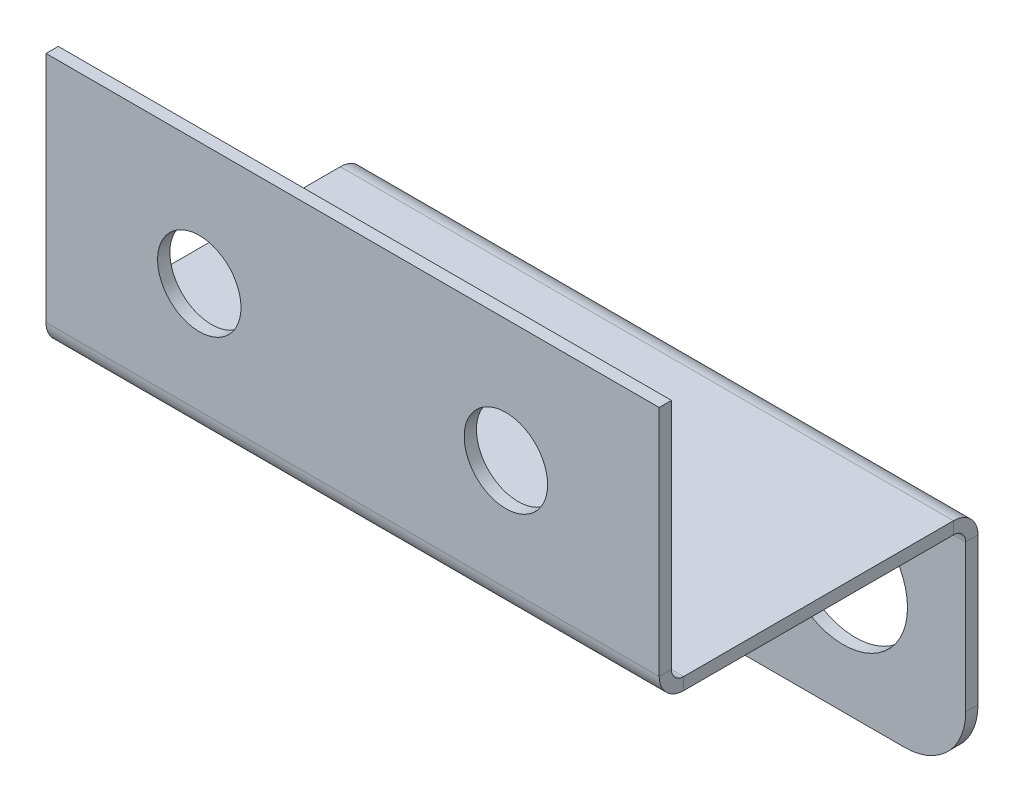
ISO-10303-21;
HEADER;
FILE_DESCRIPTION(('STEP AP214'),'2;1');
FILE_NAME('part.step','',(''),(''),'','','');
FILE_SCHEMA(('AUTOMOTIVE_DESIGN { 1 0 10303 214 1 1 1 1 }'));
ENDSEC;
DATA;
#1=APPLICATION_CONTEXT('core data for automotive mechanical design processes');
#2=APPLICATION_PROTOCOL_DEFINITION('international standard','automotive_design',2000,#1);
#3=PRODUCT_CONTEXT('',#1,'mechanical');
#4=PRODUCT('Part','Part','',(#3));
#5=PRODUCT_RELATED_PRODUCT_CATEGORY('part','',(#4));
#6=PRODUCT_DEFINITION_FORMATION('','',#4);
#7=PRODUCT_DEFINITION_CONTEXT('part definition',#1,'design');
#8=PRODUCT_DEFINITION('design','',#6,#7);
#9=PRODUCT_DEFINITION_SHAPE('','',#8);
#10=(LENGTH_UNIT() NAMED_UNIT(*) SI_UNIT(.MILLI.,.METRE.));
#11=(NAMED_UNIT(*) PLANE_ANGLE_UNIT() SI_UNIT($,.RADIAN.));
#12=(NAMED_UNIT(*) SI_UNIT($,.STERADIAN.) SOLID_ANGLE_UNIT());
#13=UNCERTAINTY_MEASURE_WITH_UNIT(LENGTH_MEASURE(1.E-05),#10,'distance_accuracy_value','');
#14=(GEOMETRIC_REPRESENTATION_CONTEXT(3) GLOBAL_UNCERTAINTY_ASSIGNED_CONTEXT((#13)) GLOBAL_UNIT_ASSIGNED_CONTEXT((#10,
#11,#12)) REPRESENTATION_CONTEXT('',''));
#15=CARTESIAN_POINT('',(0.,0.,0.));
#16=DIRECTION('',(0.,0.,1.));
#17=DIRECTION('',(1.,0.,0.));
#18=AXIS2_PLACEMENT_3D('',#15,#16,#17);
#19=CARTESIAN_POINT('',(25.0000000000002,-20.0000000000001,-1.));
#20=DIRECTION('',(1.00000000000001,0.,0.));
#21=DIRECTION('',(0.,0.,-1.));
#22=AXIS2_PLACEMENT_3D('',#19,#20,#21);
#23=PLANE('',#22);
#24=DIRECTION('',(0.,-1.00000000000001,0.));
#25=VECTOR('',#24,1.);
#26=CARTESIAN_POINT('',(25.0000000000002,-20.0000000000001,-1.));
#27=LINE('',#26,#25);
#28=CARTESIAN_POINT('',(25.0000000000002,-20.0000000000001,-1.));
#29=VERTEX_POINT('',#28);
#30=CARTESIAN_POINT('',(25.0000000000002,-21.0000000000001,-1.));
#31=VERTEX_POINT('',#30);
#32=EDGE_CURVE('E325',#29,#31,#27,.T.);
#33=ORIENTED_EDGE('',*,*,#32,.F.);
#34=CARTESIAN_POINT('',(25.0000000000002,-19.0000000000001,-1.));
#35=DIRECTION('',(-1.00000000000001,0.,0.));
#36=DIRECTION('',(0.,0.,1.));
#37=AXIS2_PLACEMENT_3D('',#34,#35,#36);
#38=CIRCLE('',#37,1.);
#39=CARTESIAN_POINT('',(25.0000000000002,-19.0000000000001,0.));
#40=VERTEX_POINT('',#39);
#41=EDGE_CURVE('E245',#40,#29,#38,.F.);
#42=ORIENTED_EDGE('',*,*,#41,.F.);
#43=DIRECTION('',(0.,0.,-1.));
#44=VECTOR('',#43,1.);
#45=CARTESIAN_POINT('',(25.0000000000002,-19.0000000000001,1.));
#46=LINE('',#45,#44);
#47=CARTESIAN_POINT('',(25.0000000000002,-19.0000000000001,1.));
#48=VERTEX_POINT('',#47);
#49=EDGE_CURVE('E322',#48,#40,#46,.T.);
#50=ORIENTED_EDGE('',*,*,#49,.F.);
#51=CARTESIAN_POINT('',(25.0000000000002,-19.0000000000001,-1.));
#52=DIRECTION('',(1.00000000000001,0.,0.));
#53=DIRECTION('',(0.,0.,-1.));
#54=AXIS2_PLACEMENT_3D('',#51,#52,#53);
#55=CIRCLE('',#54,2.);
#56=EDGE_CURVE('E261',#48,#31,#55,.T.);
#57=ORIENTED_EDGE('',*,*,#56,.T.);
#58=EDGE_LOOP('',(#33,#42,#50,#57));
#59=FACE_BOUND('',#58,.T.);
#60=ADVANCED_FACE('F56',(#59),#23,.T.);
#61=CARTESIAN_POINT('',(25.0000000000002,-19.0000000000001,1.));
#62=DIRECTION('',(1.00000000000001,0.,0.));
#63=DIRECTION('',(0.,0.,-1.));
#64=AXIS2_PLACEMENT_3D('',#61,#62,#63);
#65=PLANE('',#64);
#66=DIRECTION('',(0.,0.,-1.));
#67=VECTOR('',#66,1.);
#68=CARTESIAN_POINT('',(25.0000000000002,-20.0000000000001,0.));
#69=LINE('',#68,#67);
#70=CARTESIAN_POINT('',(25.0000000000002,-20.0000000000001,-23.));
#71=VERTEX_POINT('',#70);
#72=EDGE_CURVE('E241',#29,#71,#69,.T.);
#73=ORIENTED_EDGE('',*,*,#72,.F.);
#74=ORIENTED_EDGE('',*,*,#32,.T.);
#75=DIRECTION('',(0.,0.,-1.));
#76=VECTOR('',#75,1.);
#77=CARTESIAN_POINT('',(25.0000000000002,-21.0000000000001,0.));
#78=LINE('',#77,#76);
#79=CARTESIAN_POINT('',(25.0000000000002,-21.0000000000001,-23.));
#80=VERTEX_POINT('',#79);
#81=EDGE_CURVE('E265',#31,#80,#78,.T.);
#82=ORIENTED_EDGE('',*,*,#81,.T.);
#83=DIRECTION('',(0.,1.00000000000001,0.));
#84=VECTOR('',#83,1.);
#85=CARTESIAN_POINT('',(25.0000000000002,-21.0000000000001,-23.));
#86=LINE('',#85,#84);
#87=EDGE_CURVE('E310',#80,#71,#86,.T.);
#88=ORIENTED_EDGE('',*,*,#87,.T.);
#89=EDGE_LOOP('',(#73,#74,#82,#88));
#90=FACE_BOUND('',#89,.T.);
#91=ADVANCED_FACE('F439',(#90),#65,.T.);
#92=CARTESIAN_POINT('',(-25.0000000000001,-19.0000000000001,0.));
#93=DIRECTION('',(-1.00000000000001,0.,0.));
#94=DIRECTION('',(0.,0.,1.));
#95=AXIS2_PLACEMENT_3D('',#92,#93,#94);
#96=PLANE('',#95);
#97=DIRECTION('',(0.,0.,1.));
#98=VECTOR('',#97,1.);
#99=CARTESIAN_POINT('',(-25.0000000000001,-19.0000000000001,0.));
#100=LINE('',#99,#98);
#101=CARTESIAN_POINT('',(-25.0000000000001,-19.0000000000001,0.));
#102=VERTEX_POINT('',#101);
#103=CARTESIAN_POINT('',(-25.0000000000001,-19.0000000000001,1.));
#104=VERTEX_POINT('',#103);
#105=EDGE_CURVE('E319',#102,#104,#100,.T.);
#106=ORIENTED_EDGE('',*,*,#105,.F.);
#107=CARTESIAN_POINT('',(-25.0000000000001,-19.0000000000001,-1.));
#108=DIRECTION('',(-1.00000000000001,0.,0.));
#109=DIRECTION('',(0.,0.,1.));
#110=AXIS2_PLACEMENT_3D('',#107,#108,#109);
#111=CIRCLE('',#110,1.);
#112=CARTESIAN_POINT('',(-25.0000000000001,-20.0000000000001,-1.));
#113=VERTEX_POINT('',#112);
#114=EDGE_CURVE('E204',#102,#113,#111,.F.);
#115=ORIENTED_EDGE('',*,*,#114,.T.);
#116=DIRECTION('',(0.,1.00000000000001,0.));
#117=VECTOR('',#116,1.);
#118=CARTESIAN_POINT('',(-25.0000000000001,-21.0000000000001,-1.));
#119=LINE('',#118,#117);
#120=CARTESIAN_POINT('',(-25.0000000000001,-21.0000000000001,-1.));
#121=VERTEX_POINT('',#120);
#122=EDGE_CURVE('E316',#121,#113,#119,.T.);
#123=ORIENTED_EDGE('',*,*,#122,.F.);
#124=CARTESIAN_POINT('',(-25.0000000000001,-19.0000000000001,-1.));
#125=DIRECTION('',(1.00000000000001,0.,0.));
#126=DIRECTION('',(0.,0.,-1.));
#127=AXIS2_PLACEMENT_3D('',#124,#125,#126);
#128=CIRCLE('',#127,2.);
#129=EDGE_CURVE('E223',#104,#121,#128,.T.);
#130=ORIENTED_EDGE('',*,*,#129,.F.);
#131=EDGE_LOOP('',(#106,#115,#123,#130));
#132=FACE_BOUND('',#131,.T.);
#133=ADVANCED_FACE('F411',(#132),#96,.T.);
#134=CARTESIAN_POINT('',(-25.0000000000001,-21.0000000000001,-1.));
#135=DIRECTION('',(-1.00000000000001,0.,0.));
#136=DIRECTION('',(0.,0.,1.));
#137=AXIS2_PLACEMENT_3D('',#134,#135,#136);
#138=PLANE('',#137);
#139=DIRECTION('',(0.,-1.00000000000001,0.));
#140=VECTOR('',#139,1.);
#141=CARTESIAN_POINT('',(-25.0000000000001,0.,0.));
#142=LINE('',#141,#140);
#143=CARTESIAN_POINT('',(-25.0000000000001,0.,0.));
#144=VERTEX_POINT('',#143);
#145=EDGE_CURVE('E211',#144,#102,#142,.T.);
#146=ORIENTED_EDGE('',*,*,#145,.T.);
#147=ORIENTED_EDGE('',*,*,#105,.T.);
#148=DIRECTION('',(0.,-1.00000000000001,0.));
#149=VECTOR('',#148,1.);
#150=CARTESIAN_POINT('',(-25.0000000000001,0.,1.));
#151=LINE('',#150,#149);
#152=CARTESIAN_POINT('',(-25.0000000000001,0.,1.));
#153=VERTEX_POINT('',#152);
#154=EDGE_CURVE('E219',#153,#104,#151,.T.);
#155=ORIENTED_EDGE('',*,*,#154,.F.);
#156=DIRECTION('',(0.,0.,-1.));
#157=VECTOR('',#156,1.);
#158=CARTESIAN_POINT('',(-25.0000000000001,0.,1.));
#159=LINE('',#158,#157);
#160=EDGE_CURVE('E215',#153,#144,#159,.T.);
#161=ORIENTED_EDGE('',*,*,#160,.T.);
#162=EDGE_LOOP('',(#146,#147,#155,#161));
#163=FACE_BOUND('',#162,.T.);
#164=ADVANCED_FACE('F419',(#163),#138,.T.);
#165=CARTESIAN_POINT('',(25.0000000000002,-22.0000000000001,-24.9999999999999));
#166=DIRECTION('',(1.00000000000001,0.,0.));
#167=DIRECTION('',(0.,0.,-1.));
#168=AXIS2_PLACEMENT_3D('',#165,#166,#167);
#169=PLANE('',#168);
#170=DIRECTION('',(0.,0.,1.));
#171=VECTOR('',#170,1.);
#172=CARTESIAN_POINT('',(25.0000000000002,-22.0000000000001,-24.9999999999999));
#173=LINE('',#172,#171);
#174=CARTESIAN_POINT('',(25.0000000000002,-22.0000000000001,-24.9999999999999));
#175=VERTEX_POINT('',#174);
#176=CARTESIAN_POINT('',(25.0000000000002,-22.0000000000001,-23.9999999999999));
#177=VERTEX_POINT('',#176);
#178=EDGE_CURVE('E313',#175,#177,#173,.T.);
#179=ORIENTED_EDGE('',*,*,#178,.F.);
#180=CARTESIAN_POINT('',(25.0000000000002,-22.0000000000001,-22.9999999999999));
#181=DIRECTION('',(1.00000000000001,0.,0.));
#182=DIRECTION('',(0.,0.,-1.));
#183=AXIS2_PLACEMENT_3D('',#180,#181,#182);
#184=CIRCLE('',#183,2.);
#185=EDGE_CURVE('E186',#71,#175,#184,.F.);
#186=ORIENTED_EDGE('',*,*,#185,.F.);
#187=ORIENTED_EDGE('',*,*,#87,.F.);
#188=CARTESIAN_POINT('',(25.0000000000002,-22.0000000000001,-22.9999999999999));
#189=DIRECTION('',(1.00000000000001,0.,0.));
#190=DIRECTION('',(0.,0.,-1.));
#191=AXIS2_PLACEMENT_3D('',#188,#189,#190);
#192=CIRCLE('',#191,1.);
#193=EDGE_CURVE('E269',#80,#177,#192,.F.);
#194=ORIENTED_EDGE('',*,*,#193,.T.);
#195=EDGE_LOOP('',(#179,#186,#187,#194));
#196=FACE_BOUND('',#195,.T.);
#197=ADVANCED_FACE('F441',(#196),#169,.T.);
#198=CARTESIAN_POINT('',(25.0000000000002,-21.0000000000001,-23.));
#199=DIRECTION('',(1.00000000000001,0.,0.));
#200=DIRECTION('',(0.,0.,-1.));
#201=AXIS2_PLACEMENT_3D('',#198,#199,#200);
#202=PLANE('',#201);
#203=DIRECTION('',(0.,-1.00000000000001,0.));
#204=VECTOR('',#203,1.);
#205=CARTESIAN_POINT('',(25.0000000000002,-20.0000000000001,-24.));
#206=LINE('',#205,#204);
#207=CARTESIAN_POINT('',(25.,-34.0000000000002,-24.));
#208=VERTEX_POINT('',#207);
#209=EDGE_CURVE('E234',#177,#208,#206,.T.);
#210=ORIENTED_EDGE('',*,*,#209,.T.);
#211=DIRECTION('',(0.,0.,1.));
#212=VECTOR('',#211,1.);
#213=CARTESIAN_POINT('',(25.,-34.0000000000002,-23.));
#214=LINE('',#213,#212);
#215=CARTESIAN_POINT('',(25.,-34.0000000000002,-25.));
#216=VERTEX_POINT('',#215);
#217=EDGE_CURVE('E11',#208,#216,#214,.F.);
#218=ORIENTED_EDGE('',*,*,#217,.T.);
#219=DIRECTION('',(0.,-1.00000000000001,0.));
#220=VECTOR('',#219,1.);
#221=CARTESIAN_POINT('',(25.0000000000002,-20.0000000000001,-25.));
#222=LINE('',#221,#220);
#223=EDGE_CURVE('E237',#175,#216,#222,.T.);
#224=ORIENTED_EDGE('',*,*,#223,.F.);
#225=ORIENTED_EDGE('',*,*,#178,.T.);
#226=EDGE_LOOP('',(#210,#218,#224,#225));
#227=FACE_BOUND('',#226,.T.);
#228=ADVANCED_FACE('F442',(#227),#202,.T.);
#229=CARTESIAN_POINT('',(-25.0000000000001,-20.0000000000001,-23.));
#230=DIRECTION('',(-1.00000000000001,0.,0.));
#231=DIRECTION('',(0.,0.,1.));
#232=AXIS2_PLACEMENT_3D('',#229,#230,#231);
#233=PLANE('',#232);
#234=DIRECTION('',(0.,-1.00000000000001,0.));
#235=VECTOR('',#234,1.);
#236=CARTESIAN_POINT('',(-25.0000000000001,-20.0000000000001,-23.));
#237=LINE('',#236,#235);
#238=CARTESIAN_POINT('',(-25.0000000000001,-20.0000000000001,-23.));
#239=VERTEX_POINT('',#238);
#240=CARTESIAN_POINT('',(-25.0000000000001,-21.0000000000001,-23.));
#241=VERTEX_POINT('',#240);
#242=EDGE_CURVE('E173',#239,#241,#237,.T.);
#243=ORIENTED_EDGE('',*,*,#242,.F.);
#244=CARTESIAN_POINT('',(-25.0000000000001,-22.0000000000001,-23.));
#245=DIRECTION('',(1.00000000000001,0.,0.));
#246=DIRECTION('',(0.,0.,-1.));
#247=AXIS2_PLACEMENT_3D('',#244,#245,#246);
#248=CIRCLE('',#247,2.);
#249=CARTESIAN_POINT('',(-25.0000000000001,-22.0000000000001,-25.));
#250=VERTEX_POINT('',#249);
#251=EDGE_CURVE('E183',#239,#250,#248,.F.);
#252=ORIENTED_EDGE('',*,*,#251,.T.);
#253=DIRECTION('',(0.,0.,-1.));
#254=VECTOR('',#253,1.);
#255=CARTESIAN_POINT('',(-25.0000000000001,-22.0000000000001,-24.));
#256=LINE('',#255,#254);
#257=CARTESIAN_POINT('',(-25.0000000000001,-22.0000000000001,-24.));
#258=VERTEX_POINT('',#257);
#259=EDGE_CURVE('E159',#258,#250,#256,.T.);
#260=ORIENTED_EDGE('',*,*,#259,.F.);
#261=CARTESIAN_POINT('',(-25.0000000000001,-22.0000000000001,-23.));
#262=DIRECTION('',(1.00000000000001,0.,0.));
#263=DIRECTION('',(0.,0.,-1.));
#264=AXIS2_PLACEMENT_3D('',#261,#262,#263);
#265=CIRCLE('',#264,1.);
#266=EDGE_CURVE('E231',#241,#258,#265,.F.);
#267=ORIENTED_EDGE('',*,*,#266,.F.);
#268=EDGE_LOOP('',(#243,#252,#260,#267));
#269=FACE_BOUND('',#268,.T.);
#270=ADVANCED_FACE('F196',(#269),#233,.T.);
#271=CARTESIAN_POINT('',(-25.0000000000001,-22.0000000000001,-24.));
#272=DIRECTION('',(-1.00000000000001,0.,0.));
#273=DIRECTION('',(0.,0.,1.));
#274=AXIS2_PLACEMENT_3D('',#271,#272,#273);
#275=PLANE('',#274);
#276=DIRECTION('',(0.,0.,-1.));
#277=VECTOR('',#276,1.);
#278=CARTESIAN_POINT('',(-25.0000000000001,-20.0000000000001,0.));
#279=LINE('',#278,#277);
#280=EDGE_CURVE('E199',#113,#239,#279,.T.);
#281=ORIENTED_EDGE('',*,*,#280,.T.);
#282=ORIENTED_EDGE('',*,*,#242,.T.);
#283=DIRECTION('',(0.,0.,-1.));
#284=VECTOR('',#283,1.);
#285=CARTESIAN_POINT('',(-25.0000000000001,-21.0000000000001,0.));
#286=LINE('',#285,#284);
#287=EDGE_CURVE('E227',#121,#241,#286,.T.);
#288=ORIENTED_EDGE('',*,*,#287,.F.);
#289=ORIENTED_EDGE('',*,*,#122,.T.);
#290=EDGE_LOOP('',(#281,#282,#288,#289));
#291=FACE_BOUND('',#290,.T.);
#292=ADVANCED_FACE('F387',(#291),#275,.T.);
#293=CARTESIAN_POINT('',(25.0000000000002,-20.0000000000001,-24.));
#294=DIRECTION('',(0.,0.,-1.));
#295=DIRECTION('',(0.,1.00000000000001,0.));
#296=AXIS2_PLACEMENT_3D('',#293,#294,#295);
#297=PLANE('',#296);
#298=CARTESIAN_POINT('',(-15.0000000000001,-29.0000000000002,-24.));
#299=DIRECTION('',(0.,0.,1.));
#300=DIRECTION('',(1.00000000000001,0.,0.));
#301=AXIS2_PLACEMENT_3D('',#298,#299,#300);
#302=CIRCLE('',#301,5.25);
#303=CARTESIAN_POINT('',(-9.7500000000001,-29.0000000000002,-24.));
#304=VERTEX_POINT('',#303);
#305=EDGE_CURVE('E349',#304,#304,#302,.T.);
#306=ORIENTED_EDGE('',*,*,#305,.F.);
#307=EDGE_LOOP('',(#306));
#308=FACE_BOUND('',#307,.T.);
#309=CARTESIAN_POINT('',(15.,-29.0000000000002,-24.));
#310=DIRECTION('',(0.,0.,1.));
#311=DIRECTION('',(1.00000000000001,0.,0.));
#312=AXIS2_PLACEMENT_3D('',#309,#310,#311);
#313=CIRCLE('',#312,5.25);
#314=CARTESIAN_POINT('',(20.25,-29.0000000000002,-24.));
#315=VERTEX_POINT('',#314);
#316=EDGE_CURVE('E352',#315,#315,#313,.T.);
#317=ORIENTED_EDGE('',*,*,#316,.F.);
#318=EDGE_LOOP('',(#317));
#319=FACE_BOUND('',#318,.T.);
#320=DIRECTION('',(0.,-1.00000000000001,0.));
#321=VECTOR('',#320,1.);
#322=CARTESIAN_POINT('',(-25.0000000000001,-20.0000000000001,-24.));
#323=LINE('',#322,#321);
#324=CARTESIAN_POINT('',(-25.0000000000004,-34.0000000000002,-24.));
#325=VERTEX_POINT('',#324);
#326=EDGE_CURVE('E167',#258,#325,#323,.T.);
#327=ORIENTED_EDGE('',*,*,#326,.T.);
#328=CARTESIAN_POINT('',(-20.0000000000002,-34.0000000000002,-24.));
#329=DIRECTION('',(0.,0.,-1.));
#330=DIRECTION('',(0.,1.00000000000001,0.));
#331=AXIS2_PLACEMENT_3D('',#328,#329,#330);
#332=CIRCLE('',#331,5.);
#333=CARTESIAN_POINT('',(-20.,-39.0000000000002,-24.));
#334=VERTEX_POINT('',#333);
#335=EDGE_CURVE('E334',#325,#334,#332,.F.);
#336=ORIENTED_EDGE('',*,*,#335,.T.);
#337=DIRECTION('',(-1.00000000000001,0.,0.));
#338=VECTOR('',#337,1.);
#339=CARTESIAN_POINT('',(25.0000000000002,-39.0000000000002,-24.));
#340=LINE('',#339,#338);
#341=CARTESIAN_POINT('',(20.0000000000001,-39.0000000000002,-24.));
#342=VERTEX_POINT('',#341);
#343=EDGE_CURVE('E174',#342,#334,#340,.T.);
#344=ORIENTED_EDGE('',*,*,#343,.F.);
#345=CARTESIAN_POINT('',(19.9999999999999,-34.0000000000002,-24.));
#346=DIRECTION('',(0.,0.,-1.));
#347=DIRECTION('',(0.,1.00000000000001,0.));
#348=AXIS2_PLACEMENT_3D('',#345,#346,#347);
#349=CIRCLE('',#348,5.);
#350=EDGE_CURVE('E331',#342,#208,#349,.F.);
#351=ORIENTED_EDGE('',*,*,#350,.T.);
#352=ORIENTED_EDGE('',*,*,#209,.F.);
#353=DIRECTION('',(-1.00000000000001,0.,0.));
#354=VECTOR('',#353,1.);
#355=CARTESIAN_POINT('',(25.0000000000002,-22.0000000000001,-23.9999999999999));
#356=LINE('',#355,#354);
#357=EDGE_CURVE('E273',#177,#258,#356,.T.);
#358=ORIENTED_EDGE('',*,*,#357,.T.);
#359=EDGE_LOOP('',(#327,#336,#344,#351,#352,#358));
#360=FACE_BOUND('',#359,.T.);
#361=ADVANCED_FACE('F383',(#308,#319,#360),#297,.F.);
#362=CARTESIAN_POINT('',(25.0000000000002,-39.0000000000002,-25.));
#363=DIRECTION('',(0.,-1.00000000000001,0.));
#364=DIRECTION('',(0.,0.,-1.));
#365=AXIS2_PLACEMENT_3D('',#362,#363,#364);
#366=PLANE('',#365);
#367=ORIENTED_EDGE('',*,*,#343,.T.);
#368=DIRECTION('',(0.,0.,1.));
#369=VECTOR('',#368,1.);
#370=CARTESIAN_POINT('',(-20.,-39.0000000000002,-25.));
#371=LINE('',#370,#369);
#372=CARTESIAN_POINT('',(-20.,-39.0000000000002,-25.));
#373=VERTEX_POINT('',#372);
#374=EDGE_CURVE('E77',#334,#373,#371,.F.);
#375=ORIENTED_EDGE('',*,*,#374,.T.);
#376=DIRECTION('',(-1.00000000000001,0.,0.));
#377=VECTOR('',#376,1.);
#378=CARTESIAN_POINT('',(25.0000000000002,-39.0000000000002,-25.));
#379=LINE('',#378,#377);
#380=CARTESIAN_POINT('',(20.0000000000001,-39.0000000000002,-25.));
#381=VERTEX_POINT('',#380);
#382=EDGE_CURVE('E189',#381,#373,#379,.T.);
#383=ORIENTED_EDGE('',*,*,#382,.F.);
#384=DIRECTION('',(0.,0.,1.));
#385=VECTOR('',#384,1.);
#386=CARTESIAN_POINT('',(20.0000000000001,-39.0000000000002,-25.));
#387=LINE('',#386,#385);
#388=EDGE_CURVE('E337',#381,#342,#387,.T.);
#389=ORIENTED_EDGE('',*,*,#388,.T.);
#390=EDGE_LOOP('',(#367,#375,#383,#389));
#391=FACE_BOUND('',#390,.T.);
#392=ADVANCED_FACE('F386',(#391),#366,.T.);
#393=CARTESIAN_POINT('',(25.0000000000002,-20.0000000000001,-25.));
#394=DIRECTION('',(0.,0.,-1.));
#395=DIRECTION('',(0.,1.00000000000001,0.));
#396=AXIS2_PLACEMENT_3D('',#393,#394,#395);
#397=PLANE('',#396);
#398=CARTESIAN_POINT('',(-15.0000000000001,-29.0000000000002,-25.));
#399=DIRECTION('',(0.,0.,-1.));
#400=DIRECTION('',(0.,1.00000000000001,0.));
#401=AXIS2_PLACEMENT_3D('',#398,#399,#400);
#402=CIRCLE('',#401,5.25);
#403=CARTESIAN_POINT('',(-15.0000000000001,-23.7500000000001,-25.));
#404=VERTEX_POINT('',#403);
#405=EDGE_CURVE('E347',#404,#404,#402,.F.);
#406=ORIENTED_EDGE('',*,*,#405,.T.);
#407=EDGE_LOOP('',(#406));
#408=FACE_BOUND('',#407,.T.);
#409=CARTESIAN_POINT('',(15.,-29.0000000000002,-25.));
#410=DIRECTION('',(0.,0.,-1.));
#411=DIRECTION('',(0.,1.00000000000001,0.));
#412=AXIS2_PLACEMENT_3D('',#409,#410,#411);
#413=CIRCLE('',#412,5.25);
#414=CARTESIAN_POINT('',(15.,-23.7500000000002,-25.));
#415=VERTEX_POINT('',#414);
#416=EDGE_CURVE('E356',#415,#415,#413,.F.);
#417=ORIENTED_EDGE('',*,*,#416,.T.);
#418=EDGE_LOOP('',(#417));
#419=FACE_BOUND('',#418,.T.);
#420=ORIENTED_EDGE('',*,*,#382,.T.);
#421=CARTESIAN_POINT('',(-20.0000000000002,-34.0000000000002,-25.));
#422=DIRECTION('',(0.,0.,-1.));
#423=DIRECTION('',(0.,1.00000000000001,0.));
#424=AXIS2_PLACEMENT_3D('',#421,#422,#423);
#425=CIRCLE('',#424,5.);
#426=CARTESIAN_POINT('',(-25.0000000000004,-34.0000000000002,-25.));
#427=VERTEX_POINT('',#426);
#428=EDGE_CURVE('E64',#373,#427,#425,.T.);
#429=ORIENTED_EDGE('',*,*,#428,.T.);
#430=DIRECTION('',(0.,-1.00000000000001,0.));
#431=VECTOR('',#430,1.);
#432=CARTESIAN_POINT('',(-25.0000000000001,-20.0000000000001,-25.));
#433=LINE('',#432,#431);
#434=EDGE_CURVE('E164',#250,#427,#433,.T.);
#435=ORIENTED_EDGE('',*,*,#434,.F.);
#436=DIRECTION('',(-1.00000000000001,0.,0.));
#437=VECTOR('',#436,1.);
#438=CARTESIAN_POINT('',(25.0000000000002,-22.0000000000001,-24.9999999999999));
#439=LINE('',#438,#437);
#440=EDGE_CURVE('E180',#175,#250,#439,.T.);
#441=ORIENTED_EDGE('',*,*,#440,.F.);
#442=ORIENTED_EDGE('',*,*,#223,.T.);
#443=CARTESIAN_POINT('',(19.9999999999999,-34.0000000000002,-25.));
#444=DIRECTION('',(0.,0.,-1.));
#445=DIRECTION('',(0.,1.00000000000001,0.));
#446=AXIS2_PLACEMENT_3D('',#443,#444,#445);
#447=CIRCLE('',#446,5.);
#448=EDGE_CURVE('E343',#216,#381,#447,.T.);
#449=ORIENTED_EDGE('',*,*,#448,.T.);
#450=EDGE_LOOP('',(#420,#429,#435,#441,#442,#449));
#451=FACE_BOUND('',#450,.T.);
#452=ADVANCED_FACE('F192',(#408,#419,#451),#397,.T.);
#453=CARTESIAN_POINT('',(25.0000000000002,-22.0000000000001,-22.9999999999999));
#454=DIRECTION('',(-1.00000000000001,0.,0.));
#455=DIRECTION('',(0.,0.,1.));
#456=AXIS2_PLACEMENT_3D('',#453,#454,#455);
#457=CYLINDRICAL_SURFACE('',#456,2.);
#458=ORIENTED_EDGE('',*,*,#251,.F.);
#459=DIRECTION('',(-1.00000000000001,0.,0.));
#460=VECTOR('',#459,1.);
#461=CARTESIAN_POINT('',(25.0000000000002,-20.0000000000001,-23.));
#462=LINE('',#461,#460);
#463=EDGE_CURVE('E190',#71,#239,#462,.T.);
#464=ORIENTED_EDGE('',*,*,#463,.F.);
#465=ORIENTED_EDGE('',*,*,#185,.T.);
#466=ORIENTED_EDGE('',*,*,#440,.T.);
#467=EDGE_LOOP('',(#458,#464,#465,#466));
#468=FACE_BOUND('',#467,.T.);
#469=ADVANCED_FACE('F181',(#468),#457,.T.);
#470=CARTESIAN_POINT('',(25.0000000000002,-20.0000000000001,0.));
#471=DIRECTION('',(0.,1.00000000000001,0.));
#472=DIRECTION('',(0.,0.,1.));
#473=AXIS2_PLACEMENT_3D('',#470,#471,#472);
#474=PLANE('',#473);
#475=ORIENTED_EDGE('',*,*,#280,.F.);
#476=DIRECTION('',(-1.00000000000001,0.,0.));
#477=VECTOR('',#476,1.);
#478=CARTESIAN_POINT('',(25.0000000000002,-20.0000000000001,-1.));
#479=LINE('',#478,#477);
#480=EDGE_CURVE('E299',#29,#113,#479,.T.);
#481=ORIENTED_EDGE('',*,*,#480,.F.);
#482=ORIENTED_EDGE('',*,*,#72,.T.);
#483=ORIENTED_EDGE('',*,*,#463,.T.);
#484=EDGE_LOOP('',(#475,#481,#482,#483));
#485=FACE_BOUND('',#484,.T.);
#486=ADVANCED_FACE('F407',(#485),#474,.T.);
#487=CARTESIAN_POINT('',(25.0000000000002,-19.0000000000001,-1.));
#488=DIRECTION('',(-1.00000000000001,0.,0.));
#489=DIRECTION('',(0.,0.,1.));
#490=AXIS2_PLACEMENT_3D('',#487,#488,#489);
#491=CYLINDRICAL_SURFACE('',#490,1.);
#492=ORIENTED_EDGE('',*,*,#114,.F.);
#493=DIRECTION('',(-1.00000000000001,0.,0.));
#494=VECTOR('',#493,1.);
#495=CARTESIAN_POINT('',(25.0000000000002,-19.0000000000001,0.));
#496=LINE('',#495,#494);
#497=EDGE_CURVE('E295',#40,#102,#496,.T.);
#498=ORIENTED_EDGE('',*,*,#497,.F.);
#499=ORIENTED_EDGE('',*,*,#41,.T.);
#500=ORIENTED_EDGE('',*,*,#480,.T.);
#501=EDGE_LOOP('',(#492,#498,#499,#500));
#502=FACE_BOUND('',#501,.T.);
#503=ADVANCED_FACE('F415',(#502),#491,.F.);
#504=CARTESIAN_POINT('',(25.0000000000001,0.,0.));
#505=DIRECTION('',(0.,0.,-1.));
#506=DIRECTION('',(0.,1.00000000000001,0.));
#507=AXIS2_PLACEMENT_3D('',#504,#505,#506);
#508=PLANE('',#507);
#509=CARTESIAN_POINT('',(-12.5,-10.,0.));
#510=DIRECTION('',(0.,0.,-1.));
#511=DIRECTION('',(0.,1.00000000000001,0.));
#512=AXIS2_PLACEMENT_3D('',#509,#510,#511);
#513=CIRCLE('',#512,3.4);
#514=CARTESIAN_POINT('',(-12.5,-6.60000000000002,0.));
#515=VERTEX_POINT('',#514);
#516=EDGE_CURVE('E355',#515,#515,#513,.F.);
#517=ORIENTED_EDGE('',*,*,#516,.T.);
#518=EDGE_LOOP('',(#517));
#519=FACE_BOUND('',#518,.T.);
#520=CARTESIAN_POINT('',(12.5000000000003,-10.,0.));
#521=DIRECTION('',(0.,0.,-1.));
#522=DIRECTION('',(0.,1.00000000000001,0.));
#523=AXIS2_PLACEMENT_3D('',#520,#521,#522);
#524=CIRCLE('',#523,3.4);
#525=CARTESIAN_POINT('',(12.5000000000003,-6.60000000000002,0.));
#526=VERTEX_POINT('',#525);
#527=EDGE_CURVE('E364',#526,#526,#524,.F.);
#528=ORIENTED_EDGE('',*,*,#527,.T.);
#529=EDGE_LOOP('',(#528));
#530=FACE_BOUND('',#529,.T.);
#531=ORIENTED_EDGE('',*,*,#145,.F.);
#532=DIRECTION('',(-1.00000000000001,0.,0.));
#533=VECTOR('',#532,1.);
#534=CARTESIAN_POINT('',(25.0000000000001,0.,0.));
#535=LINE('',#534,#533);
#536=CARTESIAN_POINT('',(25.0000000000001,0.,0.));
#537=VERTEX_POINT('',#536);
#538=EDGE_CURVE('E292',#537,#144,#535,.T.);
#539=ORIENTED_EDGE('',*,*,#538,.F.);
#540=DIRECTION('',(0.,-1.00000000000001,0.));
#541=VECTOR('',#540,1.);
#542=CARTESIAN_POINT('',(25.0000000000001,0.,0.));
#543=LINE('',#542,#541);
#544=EDGE_CURVE('E249',#537,#40,#543,.T.);
#545=ORIENTED_EDGE('',*,*,#544,.T.);
#546=ORIENTED_EDGE('',*,*,#497,.T.);
#547=EDGE_LOOP('',(#531,#539,#545,#546));
#548=FACE_BOUND('',#547,.T.);
#549=ADVANCED_FACE('F423',(#519,#530,#548),#508,.T.);
#550=CARTESIAN_POINT('',(25.0000000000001,0.,1.));
#551=DIRECTION('',(0.,1.00000000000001,0.));
#552=DIRECTION('',(0.,0.,1.));
#553=AXIS2_PLACEMENT_3D('',#550,#551,#552);
#554=PLANE('',#553);
#555=ORIENTED_EDGE('',*,*,#160,.F.);
#556=DIRECTION('',(-1.00000000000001,0.,0.));
#557=VECTOR('',#556,1.);
#558=CARTESIAN_POINT('',(25.0000000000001,0.,1.));
#559=LINE('',#558,#557);
#560=CARTESIAN_POINT('',(25.0000000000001,0.,1.));
#561=VERTEX_POINT('',#560);
#562=EDGE_CURVE('E289',#561,#153,#559,.T.);
#563=ORIENTED_EDGE('',*,*,#562,.F.);
#564=DIRECTION('',(0.,0.,-1.));
#565=VECTOR('',#564,1.);
#566=CARTESIAN_POINT('',(25.0000000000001,0.,1.));
#567=LINE('',#566,#565);
#568=EDGE_CURVE('E253',#561,#537,#567,.T.);
#569=ORIENTED_EDGE('',*,*,#568,.T.);
#570=ORIENTED_EDGE('',*,*,#538,.T.);
#571=EDGE_LOOP('',(#555,#563,#569,#570));
#572=FACE_BOUND('',#571,.T.);
#573=ADVANCED_FACE('F429',(#572),#554,.T.);
#574=CARTESIAN_POINT('',(25.0000000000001,0.,1.));
#575=DIRECTION('',(0.,0.,-1.));
#576=DIRECTION('',(0.,1.00000000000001,0.));
#577=AXIS2_PLACEMENT_3D('',#574,#575,#576);
#578=PLANE('',#577);
#579=CARTESIAN_POINT('',(-12.5,-10.0000000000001,1.));
#580=DIRECTION('',(0.,0.,1.));
#581=DIRECTION('',(1.00000000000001,0.,0.));
#582=AXIS2_PLACEMENT_3D('',#579,#580,#581);
#583=CIRCLE('',#582,3.4);
#584=CARTESIAN_POINT('',(-9.09999999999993,-10.0000000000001,1.));
#585=VERTEX_POINT('',#584);
#586=EDGE_CURVE('E359',#585,#585,#583,.T.);
#587=ORIENTED_EDGE('',*,*,#586,.F.);
#588=EDGE_LOOP('',(#587));
#589=FACE_BOUND('',#588,.T.);
#590=CARTESIAN_POINT('',(12.5000000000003,-10.0000000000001,1.));
#591=DIRECTION('',(0.,0.,1.));
#592=DIRECTION('',(1.00000000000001,0.,0.));
#593=AXIS2_PLACEMENT_3D('',#590,#591,#592);
#594=CIRCLE('',#593,3.4);
#595=CARTESIAN_POINT('',(15.9000000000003,-10.0000000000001,1.));
#596=VERTEX_POINT('',#595);
#597=EDGE_CURVE('E362',#596,#596,#594,.T.);
#598=ORIENTED_EDGE('',*,*,#597,.F.);
#599=EDGE_LOOP('',(#598));
#600=FACE_BOUND('',#599,.T.);
#601=ORIENTED_EDGE('',*,*,#154,.T.);
#602=DIRECTION('',(-1.00000000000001,0.,0.));
#603=VECTOR('',#602,1.);
#604=CARTESIAN_POINT('',(25.0000000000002,-19.0000000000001,1.));
#605=LINE('',#604,#603);
#606=EDGE_CURVE('E285',#48,#104,#605,.T.);
#607=ORIENTED_EDGE('',*,*,#606,.F.);
#608=DIRECTION('',(0.,-1.00000000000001,0.));
#609=VECTOR('',#608,1.);
#610=CARTESIAN_POINT('',(25.0000000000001,0.,1.));
#611=LINE('',#610,#609);
#612=EDGE_CURVE('E257',#561,#48,#611,.T.);
#613=ORIENTED_EDGE('',*,*,#612,.F.);
#614=ORIENTED_EDGE('',*,*,#562,.T.);
#615=EDGE_LOOP('',(#601,#607,#613,#614));
#616=FACE_BOUND('',#615,.T.);
#617=ADVANCED_FACE('F433',(#589,#600,#616),#578,.F.);
#618=CARTESIAN_POINT('',(25.0000000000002,-19.0000000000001,-1.));
#619=DIRECTION('',(-1.00000000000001,0.,0.));
#620=DIRECTION('',(0.,0.,1.));
#621=AXIS2_PLACEMENT_3D('',#618,#619,#620);
#622=CYLINDRICAL_SURFACE('',#621,2.);
#623=ORIENTED_EDGE('',*,*,#129,.T.);
#624=DIRECTION('',(-1.00000000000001,0.,0.));
#625=VECTOR('',#624,1.);
#626=CARTESIAN_POINT('',(25.0000000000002,-21.0000000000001,-1.));
#627=LINE('',#626,#625);
#628=EDGE_CURVE('E281',#31,#121,#627,.T.);
#629=ORIENTED_EDGE('',*,*,#628,.F.);
#630=ORIENTED_EDGE('',*,*,#56,.F.);
#631=ORIENTED_EDGE('',*,*,#606,.T.);
#632=EDGE_LOOP('',(#623,#629,#630,#631));
#633=FACE_BOUND('',#632,.T.);
#634=ADVANCED_FACE('F436',(#633),#622,.T.);
#635=CARTESIAN_POINT('',(25.0000000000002,-21.0000000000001,0.));
#636=DIRECTION('',(0.,1.00000000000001,0.));
#637=DIRECTION('',(0.,0.,1.));
#638=AXIS2_PLACEMENT_3D('',#635,#636,#637);
#639=PLANE('',#638);
#640=ORIENTED_EDGE('',*,*,#287,.T.);
#641=DIRECTION('',(-1.00000000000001,0.,0.));
#642=VECTOR('',#641,1.);
#643=CARTESIAN_POINT('',(25.0000000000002,-21.0000000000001,-23.));
#644=LINE('',#643,#642);
#645=EDGE_CURVE('E277',#80,#241,#644,.T.);
#646=ORIENTED_EDGE('',*,*,#645,.F.);
#647=ORIENTED_EDGE('',*,*,#81,.F.);
#648=ORIENTED_EDGE('',*,*,#628,.T.);
#649=EDGE_LOOP('',(#640,#646,#647,#648));
#650=FACE_BOUND('',#649,.T.);
#651=ADVANCED_FACE('F400',(#650),#639,.F.);
#652=CARTESIAN_POINT('',(25.0000000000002,-22.0000000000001,-22.9999999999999));
#653=DIRECTION('',(-1.00000000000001,0.,0.));
#654=DIRECTION('',(0.,0.,1.));
#655=AXIS2_PLACEMENT_3D('',#652,#653,#654);
#656=CYLINDRICAL_SURFACE('',#655,1.);
#657=ORIENTED_EDGE('',*,*,#266,.T.);
#658=ORIENTED_EDGE('',*,*,#357,.F.);
#659=ORIENTED_EDGE('',*,*,#193,.F.);
#660=ORIENTED_EDGE('',*,*,#645,.T.);
#661=EDGE_LOOP('',(#657,#658,#659,#660));
#662=FACE_BOUND('',#661,.T.);
#663=ADVANCED_FACE('F396',(#662),#656,.F.);
#664=CARTESIAN_POINT('',(25.0000000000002,-22.0000000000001,-22.9999999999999));
#665=DIRECTION('',(1.00000000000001,0.,0.));
#666=DIRECTION('',(0.,0.,-1.));
#667=AXIS2_PLACEMENT_3D('',#664,#665,#666);
#668=PLANE('',#667);
#669=ORIENTED_EDGE('',*,*,#612,.T.);
#670=ORIENTED_EDGE('',*,*,#49,.T.);
#671=ORIENTED_EDGE('',*,*,#544,.F.);
#672=ORIENTED_EDGE('',*,*,#568,.F.);
#673=EDGE_LOOP('',(#669,#670,#671,#672));
#674=FACE_BOUND('',#673,.T.);
#675=ADVANCED_FACE('F427',(#674),#668,.T.);
#676=CARTESIAN_POINT('',(-25.0000000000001,-22.0000000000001,-23.));
#677=DIRECTION('',(1.00000000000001,0.,0.));
#678=DIRECTION('',(0.,0.,-1.));
#679=AXIS2_PLACEMENT_3D('',#676,#677,#678);
#680=PLANE('',#679);
#681=ORIENTED_EDGE('',*,*,#434,.T.);
#682=DIRECTION('',(0.,0.,1.));
#683=VECTOR('',#682,1.);
#684=CARTESIAN_POINT('',(-25.0000000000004,-34.0000000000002,-24.));
#685=LINE('',#684,#683);
#686=EDGE_CURVE('E328',#427,#325,#685,.T.);
#687=ORIENTED_EDGE('',*,*,#686,.T.);
#688=ORIENTED_EDGE('',*,*,#326,.F.);
#689=ORIENTED_EDGE('',*,*,#259,.T.);
#690=EDGE_LOOP('',(#681,#687,#688,#689));
#691=FACE_BOUND('',#690,.T.);
#692=ADVANCED_FACE('F161',(#691),#680,.F.);
#693=CARTESIAN_POINT('',(12.5000000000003,-10.0000000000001,-25.0010000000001));
#694=DIRECTION('',(0.,0.,1.));
#695=DIRECTION('',(1.00000000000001,0.,0.));
#696=AXIS2_PLACEMENT_3D('',#693,#694,#695);
#697=CYLINDRICAL_SURFACE('',#696,3.4);
#698=ORIENTED_EDGE('',*,*,#527,.F.);
#699=EDGE_LOOP('',(#698));
#700=FACE_BOUND('',#699,.T.);
#701=ORIENTED_EDGE('',*,*,#597,.T.);
#702=EDGE_LOOP('',(#701));
#703=FACE_BOUND('',#702,.T.);
#704=ADVANCED_FACE('F507',(#700,#703),#697,.F.);
#705=CARTESIAN_POINT('',(-12.5,-10.0000000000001,-25.0010000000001));
#706=DIRECTION('',(0.,0.,1.));
#707=DIRECTION('',(1.00000000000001,0.,0.));
#708=AXIS2_PLACEMENT_3D('',#705,#706,#707);
#709=CYLINDRICAL_SURFACE('',#708,3.4);
#710=ORIENTED_EDGE('',*,*,#516,.F.);
#711=EDGE_LOOP('',(#710));
#712=FACE_BOUND('',#711,.T.);
#713=ORIENTED_EDGE('',*,*,#586,.T.);
#714=EDGE_LOOP('',(#713));
#715=FACE_BOUND('',#714,.T.);
#716=ADVANCED_FACE('F510',(#712,#715),#709,.F.);
#717=CARTESIAN_POINT('',(15.,-29.0000000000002,-25.0010000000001));
#718=DIRECTION('',(0.,0.,1.));
#719=DIRECTION('',(1.00000000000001,0.,0.));
#720=AXIS2_PLACEMENT_3D('',#717,#718,#719);
#721=CYLINDRICAL_SURFACE('',#720,5.25);
#722=ORIENTED_EDGE('',*,*,#416,.F.);
#723=EDGE_LOOP('',(#722));
#724=FACE_BOUND('',#723,.T.);
#725=ORIENTED_EDGE('',*,*,#316,.T.);
#726=EDGE_LOOP('',(#725));
#727=FACE_BOUND('',#726,.T.);
#728=ADVANCED_FACE('F456',(#724,#727),#721,.F.);
#729=CARTESIAN_POINT('',(-15.0000000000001,-29.0000000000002,-25.0010000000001));
#730=DIRECTION('',(0.,0.,1.));
#731=DIRECTION('',(1.00000000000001,0.,0.));
#732=AXIS2_PLACEMENT_3D('',#729,#730,#731);
#733=CYLINDRICAL_SURFACE('',#732,5.25);
#734=ORIENTED_EDGE('',*,*,#405,.F.);
#735=EDGE_LOOP('',(#734));
#736=FACE_BOUND('',#735,.T.);
#737=ORIENTED_EDGE('',*,*,#305,.T.);
#738=EDGE_LOOP('',(#737));
#739=FACE_BOUND('',#738,.T.);
#740=ADVANCED_FACE('F381',(#736,#739),#733,.F.);
#741=CARTESIAN_POINT('',(-20.0000000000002,-34.0000000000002,-23.));
#742=DIRECTION('',(0.,0.,-1.));
#743=DIRECTION('',(-1.00000000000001,0.,0.));
#744=AXIS2_PLACEMENT_3D('',#741,#742,#743);
#745=CYLINDRICAL_SURFACE('',#744,5.);
#746=ORIENTED_EDGE('',*,*,#428,.F.);
#747=ORIENTED_EDGE('',*,*,#374,.F.);
#748=ORIENTED_EDGE('',*,*,#335,.F.);
#749=ORIENTED_EDGE('',*,*,#686,.F.);
#750=EDGE_LOOP('',(#746,#747,#748,#749));
#751=FACE_BOUND('',#750,.T.);
#752=ADVANCED_FACE('F448',(#751),#745,.T.);
#753=CARTESIAN_POINT('',(19.9999999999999,-34.0000000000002,-25.));
#754=DIRECTION('',(0.,0.,1.));
#755=DIRECTION('',(1.00000000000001,0.,0.));
#756=AXIS2_PLACEMENT_3D('',#753,#754,#755);
#757=CYLINDRICAL_SURFACE('',#756,5.);
#758=ORIENTED_EDGE('',*,*,#448,.F.);
#759=ORIENTED_EDGE('',*,*,#217,.F.);
#760=ORIENTED_EDGE('',*,*,#350,.F.);
#761=ORIENTED_EDGE('',*,*,#388,.F.);
#762=EDGE_LOOP('',(#758,#759,#760,#761));
#763=FACE_BOUND('',#762,.T.);
#764=ADVANCED_FACE('F446',(#763),#757,.T.);
#765=CLOSED_SHELL('',(#60,#91,#133,#164,#197,#228,#270,#292,#361,#392,#452,#469,#486,#503,#549,
#573,#617,#634,#651,#663,#675,#692,#704,#716,#728,#740,#752,#764));
#766=MANIFOLD_SOLID_BREP('B2',#765);
#767=ADVANCED_BREP_SHAPE_REPRESENTATION('',(#18,#766),#14);
#768=SHAPE_DEFINITION_REPRESENTATION(#9,#767);
ENDSEC;
END-ISO-10303-21;
